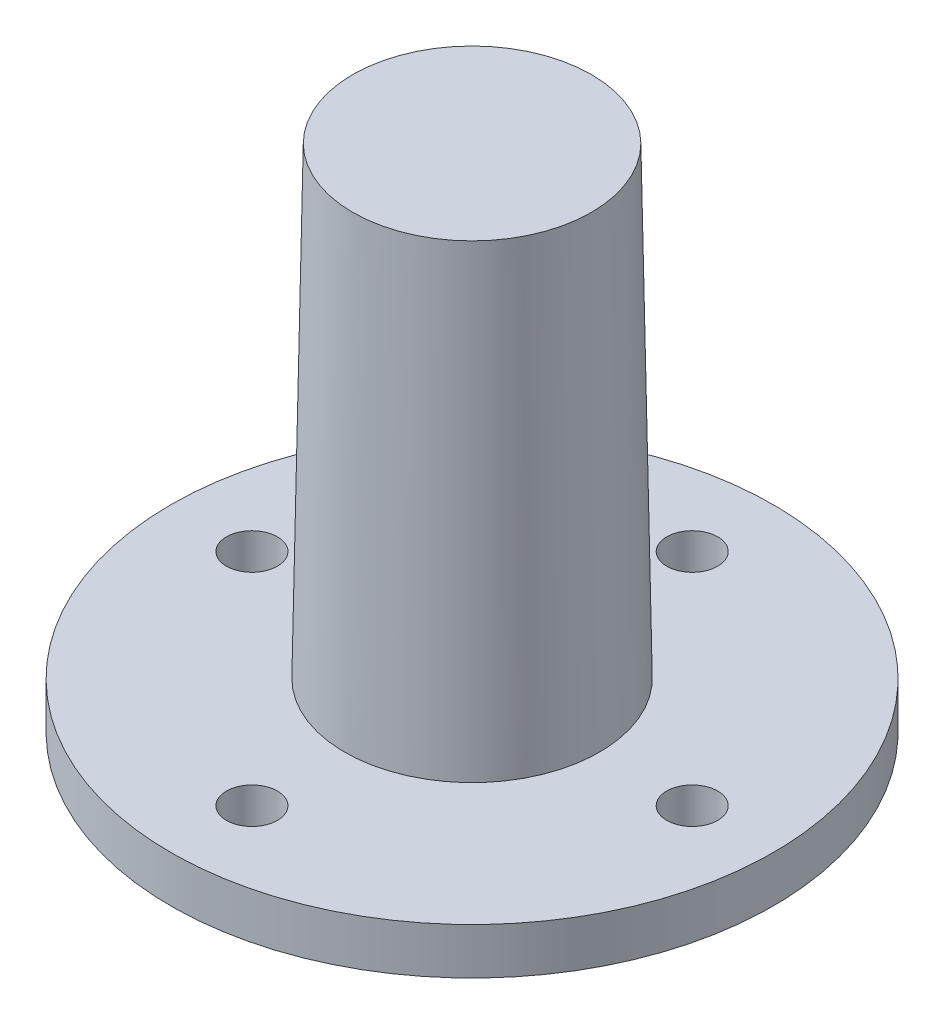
ISO-10303-21;
HEADER;
FILE_DESCRIPTION(('STEP AP214'),'2;1');
FILE_NAME('part.step','',(''),(''),'','','');
FILE_SCHEMA(('AUTOMOTIVE_DESIGN { 1 0 10303 214 1 1 1 1 }'));
ENDSEC;
DATA;
#1=APPLICATION_CONTEXT('core data for automotive mechanical design processes');
#2=APPLICATION_PROTOCOL_DEFINITION('international standard','automotive_design',2000,#1);
#3=PRODUCT_CONTEXT('',#1,'mechanical');
#4=PRODUCT('Part','Part','',(#3));
#5=PRODUCT_RELATED_PRODUCT_CATEGORY('part','',(#4));
#6=PRODUCT_DEFINITION_FORMATION('','',#4);
#7=PRODUCT_DEFINITION_CONTEXT('part definition',#1,'design');
#8=PRODUCT_DEFINITION('design','',#6,#7);
#9=PRODUCT_DEFINITION_SHAPE('','',#8);
#10=(LENGTH_UNIT() NAMED_UNIT(*) SI_UNIT(.MILLI.,.METRE.));
#11=(NAMED_UNIT(*) PLANE_ANGLE_UNIT() SI_UNIT($,.RADIAN.));
#12=(NAMED_UNIT(*) SI_UNIT($,.STERADIAN.) SOLID_ANGLE_UNIT());
#13=UNCERTAINTY_MEASURE_WITH_UNIT(LENGTH_MEASURE(1.E-05),#10,'distance_accuracy_value','');
#14=(GEOMETRIC_REPRESENTATION_CONTEXT(3) GLOBAL_UNCERTAINTY_ASSIGNED_CONTEXT((#13)) GLOBAL_UNIT_ASSIGNED_CONTEXT((#10,
#11,#12)) REPRESENTATION_CONTEXT('',''));
#15=CARTESIAN_POINT('',(0.,0.,0.));
#16=DIRECTION('',(0.,0.,1.));
#17=DIRECTION('',(1.,0.,0.));
#18=AXIS2_PLACEMENT_3D('',#15,#16,#17);
#19=CARTESIAN_POINT('',(55.,220.,0.));
#20=DIRECTION('',(0.,-1.,0.));
#21=DIRECTION('',(1.,0.,0.));
#22=AXIS2_PLACEMENT_3D('',#19,#20,#21);
#23=PLANE('',#22);
#24=CARTESIAN_POINT('',(0.,220.,0.));
#25=DIRECTION('',(0.,-1.,0.));
#26=DIRECTION('',(1.,0.,0.));
#27=AXIS2_PLACEMENT_3D('',#24,#25,#26);
#28=CIRCLE('',#27,51.5089870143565);
#29=CARTESIAN_POINT('',(51.5089870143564,220.,0.));
#30=VERTEX_POINT('',#29);
#31=EDGE_CURVE('E11',#30,#30,#28,.F.);
#32=ORIENTED_EDGE('',*,*,#31,.T.);
#33=EDGE_LOOP('',(#32));
#34=FACE_BOUND('',#33,.T.);
#35=ADVANCED_FACE('F38',(#34),#23,.F.);
#36=CARTESIAN_POINT('',(0.,20.,0.));
#37=DIRECTION('',(0.,-1.,0.));
#38=DIRECTION('',(-1.,0.,0.));
#39=AXIS2_PLACEMENT_3D('',#36,#37,#38);
#40=CONICAL_SURFACE('',#39,55.,0.0174532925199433);
#41=ORIENTED_EDGE('',*,*,#31,.F.);
#42=EDGE_LOOP('',(#41));
#43=FACE_BOUND('',#42,.T.);
#44=CARTESIAN_POINT('',(0.,20.,0.));
#45=DIRECTION('',(0.,1.,0.));
#46=DIRECTION('',(-1.,0.,0.));
#47=AXIS2_PLACEMENT_3D('',#44,#45,#46);
#48=CIRCLE('',#47,55.);
#49=CARTESIAN_POINT('',(-55.,19.9999999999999,0.));
#50=VERTEX_POINT('',#49);
#51=EDGE_CURVE('E46',#50,#50,#48,.T.);
#52=ORIENTED_EDGE('',*,*,#51,.T.);
#53=EDGE_LOOP('',(#52));
#54=FACE_BOUND('',#53,.T.);
#55=ADVANCED_FACE('F40',(#43,#54),#40,.T.);
#56=CARTESIAN_POINT('',(130.,20.,0.));
#57=DIRECTION('',(0.,-1.,0.));
#58=DIRECTION('',(1.,0.,0.));
#59=AXIS2_PLACEMENT_3D('',#56,#57,#58);
#60=PLANE('',#59);
#61=CARTESIAN_POINT('',(95.,20.,-9.95072757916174E-13));
#62=DIRECTION('',(0.,1.,0.));
#63=DIRECTION('',(0.,0.,1.));
#64=AXIS2_PLACEMENT_3D('',#61,#62,#63);
#65=CIRCLE('',#64,11.);
#66=CARTESIAN_POINT('',(95.,20.,10.999999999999));
#67=VERTEX_POINT('',#66);
#68=EDGE_CURVE('E83',#67,#67,#65,.T.);
#69=ORIENTED_EDGE('',*,*,#68,.F.);
#70=EDGE_LOOP('',(#69));
#71=FACE_BOUND('',#70,.T.);
#72=CARTESIAN_POINT('',(6.57389157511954E-13,20.,95.));
#73=DIRECTION('',(0.,1.,0.));
#74=DIRECTION('',(0.,0.,1.));
#75=AXIS2_PLACEMENT_3D('',#72,#73,#74);
#76=CIRCLE('',#75,11.);
#77=CARTESIAN_POINT('',(6.57389157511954E-13,20.,106.));
#78=VERTEX_POINT('',#77);
#79=EDGE_CURVE('E77',#78,#78,#76,.T.);
#80=ORIENTED_EDGE('',*,*,#79,.F.);
#81=EDGE_LOOP('',(#80));
#82=FACE_BOUND('',#81,.T.);
#83=CARTESIAN_POINT('',(-95.,19.9999999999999,3.31690919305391E-13));
#84=DIRECTION('',(0.,1.,0.));
#85=DIRECTION('',(0.,0.,1.));
#86=AXIS2_PLACEMENT_3D('',#83,#84,#85);
#87=CIRCLE('',#86,11.);
#88=CARTESIAN_POINT('',(-95.,19.9999999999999,11.0000000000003));
#89=VERTEX_POINT('',#88);
#90=EDGE_CURVE('E71',#89,#89,#87,.T.);
#91=ORIENTED_EDGE('',*,*,#90,.F.);
#92=EDGE_LOOP('',(#91));
#93=FACE_BOUND('',#92,.T.);
#94=CARTESIAN_POINT('',(0.,20.,-95.));
#95=DIRECTION('',(0.,1.,0.));
#96=DIRECTION('',(0.,0.,1.));
#97=AXIS2_PLACEMENT_3D('',#94,#95,#96);
#98=CIRCLE('',#97,11.);
#99=CARTESIAN_POINT('',(0.,20.,-84.));
#100=VERTEX_POINT('',#99);
#101=EDGE_CURVE('E65',#100,#100,#98,.T.);
#102=ORIENTED_EDGE('',*,*,#101,.F.);
#103=EDGE_LOOP('',(#102));
#104=FACE_BOUND('',#103,.T.);
#105=ORIENTED_EDGE('',*,*,#51,.F.);
#106=EDGE_LOOP('',(#105));
#107=FACE_BOUND('',#106,.T.);
#108=CARTESIAN_POINT('',(0.,20.,0.));
#109=DIRECTION('',(0.,1.,0.));
#110=DIRECTION('',(-1.,0.,0.));
#111=AXIS2_PLACEMENT_3D('',#108,#109,#110);
#112=CIRCLE('',#111,130.);
#113=CARTESIAN_POINT('',(-130.,19.9999999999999,0.));
#114=VERTEX_POINT('',#113);
#115=EDGE_CURVE('E50',#114,#114,#112,.T.);
#116=ORIENTED_EDGE('',*,*,#115,.T.);
#117=EDGE_LOOP('',(#116));
#118=FACE_BOUND('',#117,.T.);
#119=ADVANCED_FACE('F100',(#71,#82,#93,#104,#107,#118),#60,.F.);
#120=CARTESIAN_POINT('',(0.,220.,0.));
#121=DIRECTION('',(0.,1.,0.));
#122=DIRECTION('',(-1.,0.,0.));
#123=AXIS2_PLACEMENT_3D('',#120,#121,#122);
#124=CYLINDRICAL_SURFACE('',#123,130.);
#125=ORIENTED_EDGE('',*,*,#115,.F.);
#126=EDGE_LOOP('',(#125));
#127=FACE_BOUND('',#126,.T.);
#128=CARTESIAN_POINT('',(0.,0.,0.));
#129=DIRECTION('',(0.,1.,0.));
#130=DIRECTION('',(-1.,0.,0.));
#131=AXIS2_PLACEMENT_3D('',#128,#129,#130);
#132=CIRCLE('',#131,130.);
#133=CARTESIAN_POINT('',(-130.,0.,0.));
#134=VERTEX_POINT('',#133);
#135=EDGE_CURVE('E54',#134,#134,#132,.T.);
#136=ORIENTED_EDGE('',*,*,#135,.T.);
#137=EDGE_LOOP('',(#136));
#138=FACE_BOUND('',#137,.T.);
#139=ADVANCED_FACE('F103',(#127,#138),#124,.T.);
#140=CARTESIAN_POINT('',(0.,0.,0.));
#141=DIRECTION('',(0.,1.,0.));
#142=DIRECTION('',(-1.,0.,0.));
#143=AXIS2_PLACEMENT_3D('',#140,#141,#142);
#144=PLANE('',#143);
#145=CARTESIAN_POINT('',(95.,0.,-9.97595992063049E-13));
#146=DIRECTION('',(0.,1.,0.));
#147=DIRECTION('',(0.,0.,1.));
#148=AXIS2_PLACEMENT_3D('',#145,#146,#147);
#149=CIRCLE('',#148,11.);
#150=CARTESIAN_POINT('',(95.,0.,10.999999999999));
#151=VERTEX_POINT('',#150);
#152=EDGE_CURVE('E86',#151,#151,#149,.T.);
#153=ORIENTED_EDGE('',*,*,#152,.T.);
#154=EDGE_LOOP('',(#153));
#155=FACE_BOUND('',#154,.T.);
#156=CARTESIAN_POINT('',(6.57389157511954E-13,0.,95.));
#157=DIRECTION('',(0.,1.,0.));
#158=DIRECTION('',(0.,0.,1.));
#159=AXIS2_PLACEMENT_3D('',#156,#157,#158);
#160=CIRCLE('',#159,11.);
#161=CARTESIAN_POINT('',(6.57389157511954E-13,0.,106.));
#162=VERTEX_POINT('',#161);
#163=EDGE_CURVE('E80',#162,#162,#160,.T.);
#164=ORIENTED_EDGE('',*,*,#163,.T.);
#165=EDGE_LOOP('',(#164));
#166=FACE_BOUND('',#165,.T.);
#167=CARTESIAN_POINT('',(-95.,0.,3.34214153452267E-13));
#168=DIRECTION('',(0.,1.,0.));
#169=DIRECTION('',(0.,0.,1.));
#170=AXIS2_PLACEMENT_3D('',#167,#168,#169);
#171=CIRCLE('',#170,11.);
#172=CARTESIAN_POINT('',(-95.,0.,11.0000000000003));
#173=VERTEX_POINT('',#172);
#174=EDGE_CURVE('E74',#173,#173,#171,.T.);
#175=ORIENTED_EDGE('',*,*,#174,.T.);
#176=EDGE_LOOP('',(#175));
#177=FACE_BOUND('',#176,.T.);
#178=CARTESIAN_POINT('',(0.,0.,-95.));
#179=DIRECTION('',(0.,1.,0.));
#180=DIRECTION('',(0.,0.,1.));
#181=AXIS2_PLACEMENT_3D('',#178,#179,#180);
#182=CIRCLE('',#181,11.);
#183=CARTESIAN_POINT('',(0.,0.,-84.));
#184=VERTEX_POINT('',#183);
#185=EDGE_CURVE('E68',#184,#184,#182,.T.);
#186=ORIENTED_EDGE('',*,*,#185,.T.);
#187=EDGE_LOOP('',(#186));
#188=FACE_BOUND('',#187,.T.);
#189=ORIENTED_EDGE('',*,*,#135,.F.);
#190=EDGE_LOOP('',(#189));
#191=FACE_BOUND('',#190,.T.);
#192=ADVANCED_FACE('F90',(#155,#166,#177,#188,#191),#144,.F.);
#193=CARTESIAN_POINT('',(0.,20.,-95.));
#194=DIRECTION('',(0.,1.,0.));
#195=DIRECTION('',(0.,0.,1.));
#196=AXIS2_PLACEMENT_3D('',#193,#194,#195);
#197=CYLINDRICAL_SURFACE('',#196,11.);
#198=ORIENTED_EDGE('',*,*,#185,.F.);
#199=EDGE_LOOP('',(#198));
#200=FACE_BOUND('',#199,.T.);
#201=ORIENTED_EDGE('',*,*,#101,.T.);
#202=EDGE_LOOP('',(#201));
#203=FACE_BOUND('',#202,.T.);
#204=ADVANCED_FACE('F120',(#200,#203),#197,.F.);
#205=CARTESIAN_POINT('',(-95.,19.9999999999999,3.31690919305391E-13));
#206=DIRECTION('',(0.,1.,0.));
#207=DIRECTION('',(0.,0.,1.));
#208=AXIS2_PLACEMENT_3D('',#205,#206,#207);
#209=CYLINDRICAL_SURFACE('',#208,11.);
#210=ORIENTED_EDGE('',*,*,#174,.F.);
#211=EDGE_LOOP('',(#210));
#212=FACE_BOUND('',#211,.T.);
#213=ORIENTED_EDGE('',*,*,#90,.T.);
#214=EDGE_LOOP('',(#213));
#215=FACE_BOUND('',#214,.T.);
#216=ADVANCED_FACE('F125',(#212,#215),#209,.F.);
#217=CARTESIAN_POINT('',(6.57389157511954E-13,20.,95.));
#218=DIRECTION('',(0.,1.,0.));
#219=DIRECTION('',(0.,0.,1.));
#220=AXIS2_PLACEMENT_3D('',#217,#218,#219);
#221=CYLINDRICAL_SURFACE('',#220,11.);
#222=ORIENTED_EDGE('',*,*,#163,.F.);
#223=EDGE_LOOP('',(#222));
#224=FACE_BOUND('',#223,.T.);
#225=ORIENTED_EDGE('',*,*,#79,.T.);
#226=EDGE_LOOP('',(#225));
#227=FACE_BOUND('',#226,.T.);
#228=ADVANCED_FACE('F96',(#224,#227),#221,.F.);
#229=CARTESIAN_POINT('',(95.,20.,-9.95072757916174E-13));
#230=DIRECTION('',(0.,1.,0.));
#231=DIRECTION('',(0.,0.,1.));
#232=AXIS2_PLACEMENT_3D('',#229,#230,#231);
#233=CYLINDRICAL_SURFACE('',#232,11.);
#234=ORIENTED_EDGE('',*,*,#152,.F.);
#235=EDGE_LOOP('',(#234));
#236=FACE_BOUND('',#235,.T.);
#237=ORIENTED_EDGE('',*,*,#68,.T.);
#238=EDGE_LOOP('',(#237));
#239=FACE_BOUND('',#238,.T.);
#240=ADVANCED_FACE('F93',(#236,#239),#233,.F.);
#241=CLOSED_SHELL('',(#35,#55,#119,#139,#192,#204,#216,#228,#240));
#242=CARTESIAN_POINT('',(0.,40.,0.));
#243=DIRECTION('',(0.,1.,0.));
#244=DIRECTION('',(-1.,0.,0.));
#245=AXIS2_PLACEMENT_3D('',#242,#243,#244);
#246=PLANE('',#245);
#247=CARTESIAN_POINT('',(0.,40.,0.));
#248=DIRECTION('',(0.,1.,0.));
#249=DIRECTION('',(-1.,0.,0.));
#250=AXIS2_PLACEMENT_3D('',#247,#248,#249);
#251=CIRCLE('',#250,15.);
#252=CARTESIAN_POINT('',(-15.,40.,0.));
#253=VERTEX_POINT('',#252);
#254=EDGE_CURVE('E59',#253,#253,#251,.T.);
#255=ORIENTED_EDGE('',*,*,#254,.T.);
#256=EDGE_LOOP('',(#255));
#257=FACE_BOUND('',#256,.T.);
#258=ADVANCED_FACE('F151',(#257),#246,.T.);
#259=CARTESIAN_POINT('',(0.,220.,0.));
#260=DIRECTION('',(0.,1.,0.));
#261=DIRECTION('',(-1.,0.,0.));
#262=AXIS2_PLACEMENT_3D('',#259,#260,#261);
#263=CYLINDRICAL_SURFACE('',#262,15.);
#264=CARTESIAN_POINT('',(0.,180.,0.));
#265=DIRECTION('',(0.,1.,0.));
#266=DIRECTION('',(-1.,0.,0.));
#267=AXIS2_PLACEMENT_3D('',#264,#265,#266);
#268=CIRCLE('',#267,15.0000000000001);
#269=CARTESIAN_POINT('',(-15.0000000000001,180.,0.));
#270=VERTEX_POINT('',#269);
#271=EDGE_CURVE('E62',#270,#270,#268,.T.);
#272=ORIENTED_EDGE('',*,*,#271,.T.);
#273=EDGE_LOOP('',(#272));
#274=FACE_BOUND('',#273,.T.);
#275=ORIENTED_EDGE('',*,*,#254,.F.);
#276=EDGE_LOOP('',(#275));
#277=FACE_BOUND('',#276,.T.);
#278=ADVANCED_FACE('F156',(#274,#277),#263,.F.);
#279=CARTESIAN_POINT('',(55.,180.,0.));
#280=DIRECTION('',(0.,-1.,0.));
#281=DIRECTION('',(1.,0.,0.));
#282=AXIS2_PLACEMENT_3D('',#279,#280,#281);
#283=PLANE('',#282);
#284=ORIENTED_EDGE('',*,*,#271,.F.);
#285=EDGE_LOOP('',(#284));
#286=FACE_BOUND('',#285,.T.);
#287=ADVANCED_FACE('F166',(#286),#283,.T.);
#288=CLOSED_SHELL('',(#258,#278,#287));
#289=ORIENTED_CLOSED_SHELL('',*,#288,.T.);
#290=BREP_WITH_VOIDS('B2',#241,(#289));
#291=ADVANCED_BREP_SHAPE_REPRESENTATION('',(#18,#290),#14);
#292=SHAPE_DEFINITION_REPRESENTATION(#9,#291);
ENDSEC;
END-ISO-10303-21;
